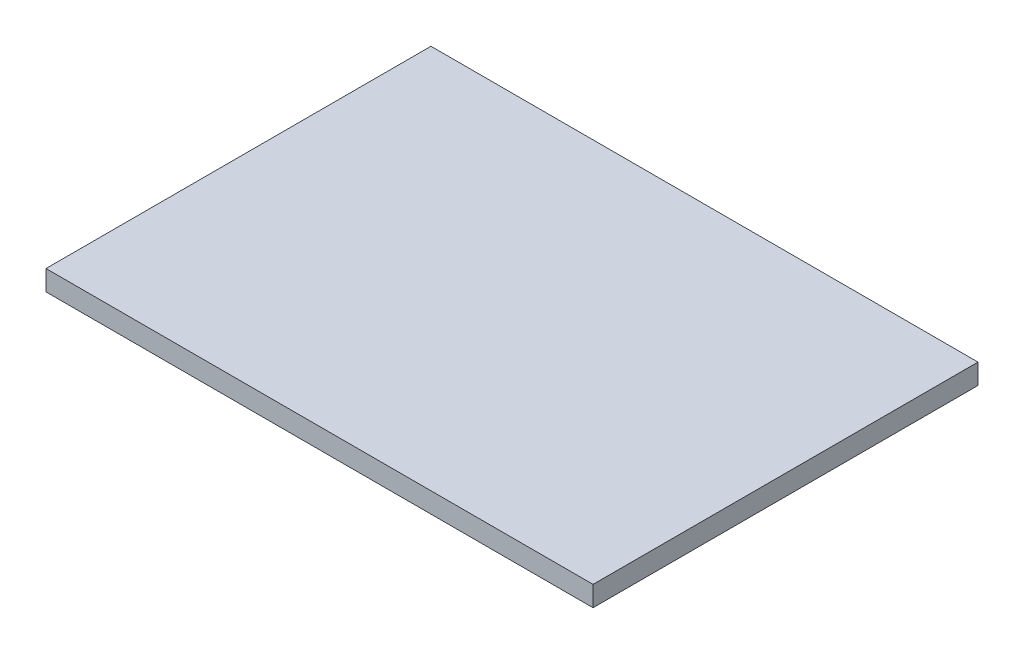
from build123d import *

# Parameters (mm, degrees)
SKETCH1_W           = 171.45
SKETCH1_H           = 120.65
BOSS_EXTRUDE1_DEPTH = 6.35


with BuildPart() as part:
    # Sketch1 → Boss-Extrude1 (new body)
    with BuildSketch(Plane(origin=(0, 0, 0), x_dir=(1, 0, 0), z_dir=(0, 1, 0))):
        with Locations((85.725, 60.325)):
            Rectangle(SKETCH1_W, SKETCH1_H)
    extrude(amount=BOSS_EXTRUDE1_DEPTH)


solid = part.part
